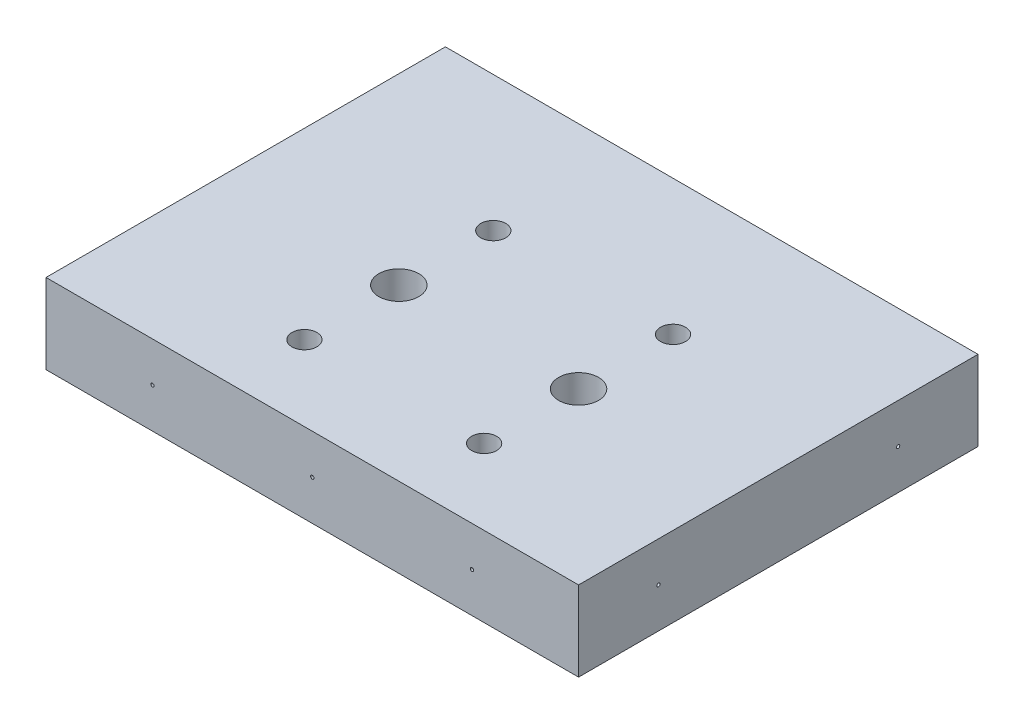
from build123d import *

# Parameters (mm, degrees)
SKETCH1_W                          = 254
SKETCH1_H                          = 190.5
BOSS_EXTRUDE1_DEPTH                = 38.1
F_1_16_0_0625_DIAMETER_HOLE7_D     = 1.5875
F_1_16_0_0625_DIAMETER_HOLE7_DEPTH = 50.8
F_1_16_0_0625_DIAMETER_HOLE7_TIP   = 0.476933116
F_3_4_0_75_DIAMETER_HOLE1_D        = 19.05
F_1_16_0_0625_DIAMETER_HOLE8_D     = 1.5875
F_1_16_0_0625_DIAMETER_HOLE8_DEPTH = 38.1
F_1_16_0_0625_DIAMETER_HOLE8_TIP   = 0.476933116
F_1_16_0_0625_DIAMETER_HOLE9_D     = 1.5875
F_1_16_0_0625_DIAMETER_HOLE9_DEPTH = 38.1
F_1_16_0_0625_DIAMETER_HOLE9_TIP   = 0.476933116
F_15_32_0_46875_DIAMETER_HOLE1_D   = 11.90625


with BuildPart() as part:
    # Sketch1 → Boss-Extrude1 (new body)
    with BuildSketch(Plane(origin=(0, 0, 0), x_dir=(1, 0, 0), z_dir=(0, 1, 0))):
        with Locations((127, 95.25)):
            Rectangle(SKETCH1_W, SKETCH1_H)
    extrude(amount=BOSS_EXTRUDE1_DEPTH)

    # 1_16 _0.0625_ Diameter Hole7
    with Locations(Plane.XY):
        with Locations((50.8, 19.05), (203.2, 19.05), (127, 19.05)):
            Hole(F_1_16_0_0625_DIAMETER_HOLE7_D / 2, depth=F_1_16_0_0625_DIAMETER_HOLE7_DEPTH)
            with Locations((0, 0, -(F_1_16_0_0625_DIAMETER_HOLE7_DEPTH + F_1_16_0_0625_DIAMETER_HOLE7_TIP / 2))):  # 118° drill point
                Cone(0, F_1_16_0_0625_DIAMETER_HOLE7_D / 2, F_1_16_0_0625_DIAMETER_HOLE7_TIP, mode=Mode.SUBTRACT)

    # 3_4 _0.75_ Diameter Hole1 (through all)
    with Locations(Plane(origin=(0, 0, 0), x_dir=(-1, 0, 0), z_dir=(0, -1, 0))):
        with Locations((-173.0375, 80.9625), (-87.3125, 80.9625)):
            Hole(F_3_4_0_75_DIAMETER_HOLE1_D / 2)

    # 1_16 _0.0625_ Diameter Hole8
    with Locations(Plane(origin=(254, 0, 0), x_dir=(0, 0, -1), z_dir=(1, 0, 0))):
        with Locations((152.4, 19.05), (38.1, 19.05)):
            Hole(F_1_16_0_0625_DIAMETER_HOLE8_D / 2, depth=F_1_16_0_0625_DIAMETER_HOLE8_DEPTH)
            with Locations((0, 0, -(F_1_16_0_0625_DIAMETER_HOLE8_DEPTH + F_1_16_0_0625_DIAMETER_HOLE8_TIP / 2))):  # 118° drill point
                Cone(0, F_1_16_0_0625_DIAMETER_HOLE8_D / 2, F_1_16_0_0625_DIAMETER_HOLE8_TIP, mode=Mode.SUBTRACT)

    # 1_16 _0.0625_ Diameter Hole9
    with Locations(Plane.ZY):
        with Locations((-152.4, 19.05), (-38.1, 19.05)):
            Hole(F_1_16_0_0625_DIAMETER_HOLE9_D / 2, depth=F_1_16_0_0625_DIAMETER_HOLE9_DEPTH)
            with Locations((0, 0, -(F_1_16_0_0625_DIAMETER_HOLE9_DEPTH + F_1_16_0_0625_DIAMETER_HOLE9_TIP / 2))):  # 118° drill point
                Cone(0, F_1_16_0_0625_DIAMETER_HOLE9_D / 2, F_1_16_0_0625_DIAMETER_HOLE9_TIP, mode=Mode.SUBTRACT)

    # 15_32 _0.46875_ Diameter Hole1 (through all)
    with Locations(Plane(origin=(0, 38.1, 0), x_dir=(1, 0, 0), z_dir=(0, 1, 0))):
        with Locations((87.3125, 35.9171875), (87.3125, 126.0078125), (173.0375, 126.0078125), (173.0375, 35.9171875)):
            Hole(F_15_32_0_46875_DIAMETER_HOLE1_D / 2)


solid = part.part
